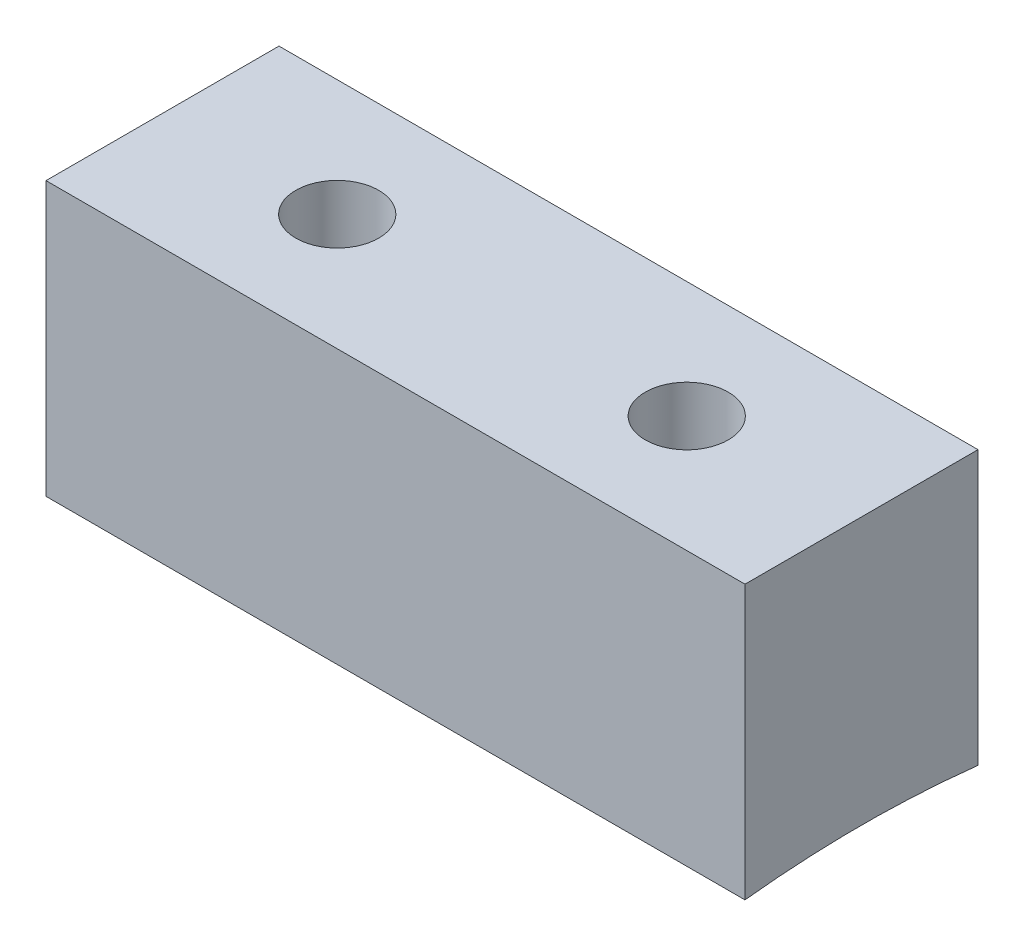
ISO-10303-21;
HEADER;
FILE_DESCRIPTION(('STEP AP214'),'2;1');
FILE_NAME('part.step','',(''),(''),'','','');
FILE_SCHEMA(('AUTOMOTIVE_DESIGN { 1 0 10303 214 1 1 1 1 }'));
ENDSEC;
DATA;
#1=APPLICATION_CONTEXT('core data for automotive mechanical design processes');
#2=APPLICATION_PROTOCOL_DEFINITION('international standard','automotive_design',2000,#1);
#3=PRODUCT_CONTEXT('',#1,'mechanical');
#4=PRODUCT('Part','Part','',(#3));
#5=PRODUCT_RELATED_PRODUCT_CATEGORY('part','',(#4));
#6=PRODUCT_DEFINITION_FORMATION('','',#4);
#7=PRODUCT_DEFINITION_CONTEXT('part definition',#1,'design');
#8=PRODUCT_DEFINITION('design','',#6,#7);
#9=PRODUCT_DEFINITION_SHAPE('','',#8);
#10=(LENGTH_UNIT() NAMED_UNIT(*) SI_UNIT(.MILLI.,.METRE.));
#11=(NAMED_UNIT(*) PLANE_ANGLE_UNIT() SI_UNIT($,.RADIAN.));
#12=(NAMED_UNIT(*) SI_UNIT($,.STERADIAN.) SOLID_ANGLE_UNIT());
#13=UNCERTAINTY_MEASURE_WITH_UNIT(LENGTH_MEASURE(1.E-05),#10,'distance_accuracy_value','');
#14=(GEOMETRIC_REPRESENTATION_CONTEXT(3) GLOBAL_UNCERTAINTY_ASSIGNED_CONTEXT((#13)) GLOBAL_UNIT_ASSIGNED_CONTEXT((#10,
#11,#12)) REPRESENTATION_CONTEXT('',''));
#15=CARTESIAN_POINT('',(0.,0.,0.));
#16=DIRECTION('',(0.,0.,1.));
#17=DIRECTION('',(1.,0.,0.));
#18=AXIS2_PLACEMENT_3D('',#15,#16,#17);
#19=CARTESIAN_POINT('',(0.,7.45236,6.35));
#20=DIRECTION('',(0.,-1.,0.));
#21=DIRECTION('',(0.,0.,-1.));
#22=AXIS2_PLACEMENT_3D('',#19,#20,#21);
#23=PLANE('',#22);
#24=DIRECTION('',(-1.,0.,0.));
#25=VECTOR('',#24,1.);
#26=CARTESIAN_POINT('',(0.,7.45236,0.));
#27=LINE('',#26,#25);
#28=CARTESIAN_POINT('',(0.,7.45236,0.));
#29=VERTEX_POINT('',#28);
#30=CARTESIAN_POINT('',(-19.05,7.45236,0.));
#31=VERTEX_POINT('',#30);
#32=EDGE_CURVE('E102',#29,#31,#27,.T.);
#33=ORIENTED_EDGE('',*,*,#32,.T.);
#34=DIRECTION('',(0.,0.,-1.));
#35=VECTOR('',#34,1.);
#36=CARTESIAN_POINT('',(-19.05,7.45236,6.35));
#37=LINE('',#36,#35);
#38=CARTESIAN_POINT('',(-19.05,7.45236,6.35));
#39=VERTEX_POINT('',#38);
#40=EDGE_CURVE('E44',#39,#31,#37,.T.);
#41=ORIENTED_EDGE('',*,*,#40,.F.);
#42=DIRECTION('',(-1.,0.,0.));
#43=VECTOR('',#42,1.);
#44=CARTESIAN_POINT('',(0.,7.45236,6.35));
#45=LINE('',#44,#43);
#46=CARTESIAN_POINT('',(0.,7.45236,6.35));
#47=VERTEX_POINT('',#46);
#48=EDGE_CURVE('E51',#47,#39,#45,.T.);
#49=ORIENTED_EDGE('',*,*,#48,.F.);
#50=DIRECTION('',(0.,0.,-1.));
#51=VECTOR('',#50,1.);
#52=CARTESIAN_POINT('',(0.,7.45236,6.35));
#53=LINE('',#52,#51);
#54=EDGE_CURVE('E11',#47,#29,#53,.T.);
#55=ORIENTED_EDGE('',*,*,#54,.T.);
#56=EDGE_LOOP('',(#33,#41,#49,#55));
#57=FACE_BOUND('',#56,.T.);
#58=CARTESIAN_POINT('',(-4.7625,7.45236,3.175));
#59=DIRECTION('',(0.,1.,0.));
#60=DIRECTION('',(0.,0.,1.));
#61=AXIS2_PLACEMENT_3D('',#58,#59,#60);
#62=CIRCLE('',#61,1.13029999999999);
#63=CARTESIAN_POINT('',(-4.7625,7.45236,4.30529999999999));
#64=VERTEX_POINT('',#63);
#65=EDGE_CURVE('E117',#64,#64,#62,.T.);
#66=ORIENTED_EDGE('',*,*,#65,.F.);
#67=EDGE_LOOP('',(#66));
#68=FACE_BOUND('',#67,.T.);
#69=CARTESIAN_POINT('',(-14.2875,7.45236,3.175));
#70=DIRECTION('',(0.,1.,0.));
#71=DIRECTION('',(0.,0.,1.));
#72=AXIS2_PLACEMENT_3D('',#69,#70,#71);
#73=CIRCLE('',#72,1.13029999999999);
#74=CARTESIAN_POINT('',(-14.2875,7.45236,4.30529999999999));
#75=VERTEX_POINT('',#74);
#76=EDGE_CURVE('E120',#75,#75,#73,.T.);
#77=ORIENTED_EDGE('',*,*,#76,.F.);
#78=EDGE_LOOP('',(#77));
#79=FACE_BOUND('',#78,.T.);
#80=ADVANCED_FACE('F31',(#57,#68,#79),#23,.F.);
#81=CARTESIAN_POINT('',(0.,0.,6.35));
#82=DIRECTION('',(-1.,0.,0.));
#83=DIRECTION('',(0.,0.,1.));
#84=AXIS2_PLACEMENT_3D('',#81,#82,#83);
#85=PLANE('',#84);
#86=DIRECTION('',(0.,1.,0.));
#87=VECTOR('',#86,1.);
#88=CARTESIAN_POINT('',(0.,0.,6.35));
#89=LINE('',#88,#87);
#90=CARTESIAN_POINT('',(0.,0.,6.35));
#91=VERTEX_POINT('',#90);
#92=EDGE_CURVE('E95',#91,#47,#89,.T.);
#93=ORIENTED_EDGE('',*,*,#92,.F.);
#94=CARTESIAN_POINT('',(0.,-28.3980633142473,3.175));
#95=DIRECTION('',(1.,0.,0.));
#96=DIRECTION('',(0.,0.,-1.));
#97=AXIS2_PLACEMENT_3D('',#94,#95,#96);
#98=CIRCLE('',#97,28.575);
#99=CARTESIAN_POINT('',(0.,0.,0.));
#100=VERTEX_POINT('',#99);
#101=EDGE_CURVE('E81',#100,#91,#98,.T.);
#102=ORIENTED_EDGE('',*,*,#101,.F.);
#103=DIRECTION('',(0.,1.,0.));
#104=VECTOR('',#103,1.);
#105=CARTESIAN_POINT('',(0.,0.,0.));
#106=LINE('',#105,#104);
#107=EDGE_CURVE('E106',#100,#29,#106,.T.);
#108=ORIENTED_EDGE('',*,*,#107,.T.);
#109=ORIENTED_EDGE('',*,*,#54,.F.);
#110=EDGE_LOOP('',(#93,#102,#108,#109));
#111=FACE_BOUND('',#110,.T.);
#112=ADVANCED_FACE('F33',(#111),#85,.F.);
#113=CARTESIAN_POINT('',(-19.05,0.,6.35));
#114=DIRECTION('',(1.,0.,0.));
#115=DIRECTION('',(0.,1.,0.));
#116=AXIS2_PLACEMENT_3D('',#113,#114,#115);
#117=PLANE('',#116);
#118=DIRECTION('',(0.,-1.,0.));
#119=VECTOR('',#118,1.);
#120=CARTESIAN_POINT('',(-19.05,0.,0.));
#121=LINE('',#120,#119);
#122=CARTESIAN_POINT('',(-19.05,0.,0.));
#123=VERTEX_POINT('',#122);
#124=EDGE_CURVE('E90',#31,#123,#121,.T.);
#125=ORIENTED_EDGE('',*,*,#124,.T.);
#126=CARTESIAN_POINT('',(-19.05,-28.3980633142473,3.175));
#127=DIRECTION('',(1.,0.,0.));
#128=DIRECTION('',(0.,0.,-1.));
#129=AXIS2_PLACEMENT_3D('',#126,#127,#128);
#130=CIRCLE('',#129,28.575);
#131=CARTESIAN_POINT('',(-19.05,0.,6.35));
#132=VERTEX_POINT('',#131);
#133=EDGE_CURVE('E78',#123,#132,#130,.T.);
#134=ORIENTED_EDGE('',*,*,#133,.T.);
#135=DIRECTION('',(0.,-1.,0.));
#136=VECTOR('',#135,1.);
#137=CARTESIAN_POINT('',(-19.05,0.,6.35));
#138=LINE('',#137,#136);
#139=EDGE_CURVE('E83',#39,#132,#138,.T.);
#140=ORIENTED_EDGE('',*,*,#139,.F.);
#141=ORIENTED_EDGE('',*,*,#40,.T.);
#142=EDGE_LOOP('',(#125,#134,#140,#141));
#143=FACE_BOUND('',#142,.T.);
#144=ADVANCED_FACE('F87',(#143),#117,.F.);
#145=CARTESIAN_POINT('',(0.,7.45236,6.35));
#146=DIRECTION('',(0.,0.,1.));
#147=DIRECTION('',(1.,0.,0.));
#148=AXIS2_PLACEMENT_3D('',#145,#146,#147);
#149=PLANE('',#148);
#150=ORIENTED_EDGE('',*,*,#92,.T.);
#151=ORIENTED_EDGE('',*,*,#48,.T.);
#152=ORIENTED_EDGE('',*,*,#139,.T.);
#153=DIRECTION('',(1.,0.,0.));
#154=VECTOR('',#153,1.);
#155=CARTESIAN_POINT('',(0.,0.,6.35));
#156=LINE('',#155,#154);
#157=EDGE_CURVE('E74',#132,#91,#156,.T.);
#158=ORIENTED_EDGE('',*,*,#157,.T.);
#159=EDGE_LOOP('',(#150,#151,#152,#158));
#160=FACE_BOUND('',#159,.T.);
#161=ADVANCED_FACE('F93',(#160),#149,.T.);
#162=CARTESIAN_POINT('',(0.,7.45236,0.));
#163=DIRECTION('',(0.,0.,1.));
#164=DIRECTION('',(1.,0.,0.));
#165=AXIS2_PLACEMENT_3D('',#162,#163,#164);
#166=PLANE('',#165);
#167=ORIENTED_EDGE('',*,*,#107,.F.);
#168=DIRECTION('',(1.,0.,0.));
#169=VECTOR('',#168,1.);
#170=CARTESIAN_POINT('',(0.,0.,0.));
#171=LINE('',#170,#169);
#172=EDGE_CURVE('E103',#123,#100,#171,.T.);
#173=ORIENTED_EDGE('',*,*,#172,.F.);
#174=ORIENTED_EDGE('',*,*,#124,.F.);
#175=ORIENTED_EDGE('',*,*,#32,.F.);
#176=EDGE_LOOP('',(#167,#173,#174,#175));
#177=FACE_BOUND('',#176,.T.);
#178=ADVANCED_FACE('F101',(#177),#166,.F.);
#179=CARTESIAN_POINT('',(-4.7625,7.45236,3.175));
#180=DIRECTION('',(0.,1.,0.));
#181=DIRECTION('',(0.,0.,1.));
#182=AXIS2_PLACEMENT_3D('',#179,#180,#181);
#183=CYLINDRICAL_SURFACE('',#182,1.13029999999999);
#184=CARTESIAN_POINT('',(-4.7625,0.154573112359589,4.30529999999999));
#185=CARTESIAN_POINT('',(-4.82596279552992,0.154573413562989,4.3052971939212));
#186=CARTESIAN_POINT('',(-4.88947097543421,0.154786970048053,4.29993719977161));
#187=CARTESIAN_POINT('',(-5.01473645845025,0.155618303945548,4.2786305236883));
#188=CARTESIAN_POINT('',(-5.07649159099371,0.15623656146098,4.26267126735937));
#189=CARTESIAN_POINT('',(-5.19641818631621,0.157807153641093,4.2206227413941));
#190=CARTESIAN_POINT('',(-5.25459141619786,0.158759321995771,4.19453851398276));
#191=CARTESIAN_POINT('',(-5.36571745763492,0.160890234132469,4.13298792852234));
#192=CARTESIAN_POINT('',(-5.41867152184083,0.162068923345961,4.09752382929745));
#193=CARTESIAN_POINT('',(-5.51790852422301,0.164520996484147,4.01819249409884));
#194=CARTESIAN_POINT('',(-5.56418748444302,0.165794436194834,3.97432028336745));
#195=CARTESIAN_POINT('',(-5.64872685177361,0.168291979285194,3.87942755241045));
#196=CARTESIAN_POINT('',(-5.68698693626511,0.169516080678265,3.82840674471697));
#197=CARTESIAN_POINT('',(-5.75441158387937,0.171777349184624,3.72064666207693));
#198=CARTESIAN_POINT('',(-5.78357332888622,0.172814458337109,3.66390562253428));
#199=CARTESIAN_POINT('',(-5.83195533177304,0.174584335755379,3.54632822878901));
#200=CARTESIAN_POINT('',(-5.85117564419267,0.175317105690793,3.48549189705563));
#201=CARTESIAN_POINT('',(-5.87911944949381,0.17639536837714,3.36148487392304));
#202=CARTESIAN_POINT('',(-5.88784848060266,0.176741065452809,3.29831543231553));
#203=CARTESIAN_POINT('',(-5.89457901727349,0.177006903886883,3.17140696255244));
#204=CARTESIAN_POINT('',(-5.89258058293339,0.176927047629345,3.10766793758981));
#205=CARTESIAN_POINT('',(-5.87791754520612,0.17635095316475,2.9814671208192));
#206=CARTESIAN_POINT('',(-5.86525890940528,0.175854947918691,2.91900463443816));
#207=CARTESIAN_POINT('',(-5.82964404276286,0.17450271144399,2.79709195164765));
#208=CARTESIAN_POINT('',(-5.80668778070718,0.173646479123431,2.73764176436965));
#209=CARTESIAN_POINT('',(-5.75112247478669,0.171669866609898,2.62342202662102));
#210=CARTESIAN_POINT('',(-5.71851070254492,0.170549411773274,2.56865380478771));
#211=CARTESIAN_POINT('',(-5.64456211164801,0.168170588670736,2.4653672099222));
#212=CARTESIAN_POINT('',(-5.60322525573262,0.166912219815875,2.41684886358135));
#213=CARTESIAN_POINT('',(-5.51296613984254,0.164398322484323,2.32740448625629));
#214=CARTESIAN_POINT('',(-5.46403870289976,0.16314279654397,2.28648367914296));
#215=CARTESIAN_POINT('',(-5.36000552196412,0.160776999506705,2.21343619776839));
#216=CARTESIAN_POINT('',(-5.30489977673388,0.159666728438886,2.18130952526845));
#217=CARTESIAN_POINT('',(-5.19007119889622,0.157716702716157,2.12676279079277));
#218=CARTESIAN_POINT('',(-5.13034828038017,0.156876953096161,2.10434290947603));
#219=CARTESIAN_POINT('',(-5.00798203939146,0.155562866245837,2.06984959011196));
#220=CARTESIAN_POINT('',(-4.94533873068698,0.155088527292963,2.05777610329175));
#221=CARTESIAN_POINT('',(-4.81895539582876,0.154559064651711,2.04432472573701));
#222=CARTESIAN_POINT('',(-4.75521614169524,0.154503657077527,2.04293959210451));
#223=CARTESIAN_POINT('',(-4.62841028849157,0.154817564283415,2.05088535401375));
#224=CARTESIAN_POINT('',(-4.56534368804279,0.155186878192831,2.06021622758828));
#225=CARTESIAN_POINT('',(-4.4416936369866,0.15630833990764,2.08932313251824));
#226=CARTESIAN_POINT('',(-4.38110940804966,0.157060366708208,2.10909586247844));
#227=CARTESIAN_POINT('',(-4.26411993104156,0.158862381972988,2.15852186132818));
#228=CARTESIAN_POINT('',(-4.20771469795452,0.159912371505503,2.18817516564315));
#229=CARTESIAN_POINT('',(-4.10065100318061,0.162192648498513,2.25653920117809));
#230=CARTESIAN_POINT('',(-4.04999565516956,0.163423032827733,2.29525480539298));
#231=CARTESIAN_POINT('',(-3.95590094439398,0.165925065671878,2.38063730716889));
#232=CARTESIAN_POINT('',(-3.91246161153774,0.167196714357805,2.4273042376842));
#233=CARTESIAN_POINT('',(-3.83400776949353,0.169638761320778,2.52729574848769));
#234=CARTESIAN_POINT('',(-3.79899793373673,0.17080910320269,2.58062399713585));
#235=CARTESIAN_POINT('',(-3.73842882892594,0.172915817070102,2.69240572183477));
#236=CARTESIAN_POINT('',(-3.71286953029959,0.173852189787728,2.75085918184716));
#237=CARTESIAN_POINT('',(-3.67193522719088,0.175385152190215,2.87121452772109));
#238=CARTESIAN_POINT('',(-3.65655721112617,0.175981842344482,2.93311538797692));
#239=CARTESIAN_POINT('',(-3.63641212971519,0.1767685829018,3.05862284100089));
#240=CARTESIAN_POINT('',(-3.63164503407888,0.176958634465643,3.1222294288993));
#241=CARTESIAN_POINT('',(-3.63285745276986,0.176910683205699,3.24929625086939));
#242=CARTESIAN_POINT('',(-3.63882962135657,0.176672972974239,3.31275655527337));
#243=CARTESIAN_POINT('',(-3.66133589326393,0.17579684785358,3.43777293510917));
#244=CARTESIAN_POINT('',(-3.67787001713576,0.175158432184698,3.49932900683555));
#245=CARTESIAN_POINT('',(-3.72102954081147,0.173552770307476,3.61879160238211));
#246=CARTESIAN_POINT('',(-3.74765507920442,0.172585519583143,3.6766980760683));
#247=CARTESIAN_POINT('',(-3.81023992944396,0.170431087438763,3.78721857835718));
#248=CARTESIAN_POINT('',(-3.84619892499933,0.169243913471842,3.8398327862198));
#249=CARTESIAN_POINT('',(-3.92645468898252,0.166782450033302,3.93831094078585));
#250=CARTESIAN_POINT('',(-3.97075625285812,0.165508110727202,3.98417097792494));
#251=CARTESIAN_POINT('',(-4.06644253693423,0.16301615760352,4.06781607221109));
#252=CARTESIAN_POINT('',(-4.11782900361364,0.161798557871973,4.10559913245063));
#253=CARTESIAN_POINT('',(-4.2262549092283,0.159556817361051,4.17202882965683));
#254=CARTESIAN_POINT('',(-4.28329870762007,0.158532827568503,4.20066834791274));
#255=CARTESIAN_POINT('',(-4.40134558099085,0.156796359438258,4.24792991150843));
#256=CARTESIAN_POINT('',(-4.46234385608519,0.156083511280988,4.26656385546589));
#257=CARTESIAN_POINT('',(-4.56352070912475,0.155239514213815,4.28836806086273));
#258=CARTESIAN_POINT('',(-4.6030431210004,0.154990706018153,4.29470950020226));
#259=CARTESIAN_POINT('',(-4.68253768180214,0.154657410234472,4.30317635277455));
#260=CARTESIAN_POINT('',(-4.72250983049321,0.15457292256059,4.30530176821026));
#261=CARTESIAN_POINT('',(-4.7625,0.154573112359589,4.30529999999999));
#262=B_SPLINE_CURVE_WITH_KNOTS('',3,(#184,#185,#186,#187,#188,#189,#190,#191,#192,#193,#194,
#195,#196,#197,#198,#199,#200,#201,#202,#203,#204,#205,#206,#207,#208,#209,#210,#211,#212,#213,
#214,#215,#216,#217,#218,#219,#220,#221,#222,#223,#224,#225,#226,#227,#228,#229,#230,#231,#232,
#233,#234,#235,#236,#237,#238,#239,#240,#241,#242,#243,#244,#245,#246,#247,#248,#249,#250,#251,
#252,#253,#254,#255,#256,#257,#258,#259,#260,#261),.UNSPECIFIED.,.T.,.F.,(4,2,2,2,2,2,2,2,2,2,2,
2,2,2,2,2,2,2,2,2,2,2,2,2,2,2,2,2,2,2,2,2,2,2,2,2,2,2,4),(0.,0.190242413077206,
0.380710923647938,0.57108470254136,0.761412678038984,0.951853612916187,1.14230220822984,
1.33280973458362,1.5233162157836,1.71372208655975,1.90412689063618,2.09442517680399,
2.28472403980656,2.47507672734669,2.66543022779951,2.85591412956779,3.04639806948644,
3.23688555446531,3.42737214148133,3.61772963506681,3.80808673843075,3.99838369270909,
4.18868132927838,4.37908152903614,4.56948251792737,4.75998882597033,4.95049453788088,
5.1409438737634,5.33139266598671,5.52171123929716,5.7120301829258,5.90235174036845,
6.09266684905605,6.28309168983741,6.47356355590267,6.66418335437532,6.85457596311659,
6.97445455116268,7.09433307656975),.UNSPECIFIED.);
#263=CARTESIAN_POINT('',(-4.7625,0.154573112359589,4.30529999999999));
#264=VERTEX_POINT('',#263);
#265=EDGE_CURVE('E122',#264,#264,#262,.T.);
#266=ORIENTED_EDGE('',*,*,#265,.T.);
#267=EDGE_LOOP('',(#266));
#268=FACE_BOUND('',#267,.T.);
#269=ORIENTED_EDGE('',*,*,#65,.T.);
#270=EDGE_LOOP('',(#269));
#271=FACE_BOUND('',#270,.T.);
#272=ADVANCED_FACE('F131',(#268,#271),#183,.F.);
#273=CARTESIAN_POINT('',(-14.2875,7.45236,3.175));
#274=DIRECTION('',(0.,1.,0.));
#275=DIRECTION('',(0.,0.,1.));
#276=AXIS2_PLACEMENT_3D('',#273,#274,#275);
#277=CYLINDRICAL_SURFACE('',#276,1.13029999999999);
#278=CARTESIAN_POINT('',(-14.2875,0.154573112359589,4.30529999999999));
#279=CARTESIAN_POINT('',(-14.3509627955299,0.154573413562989,4.3052971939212));
#280=CARTESIAN_POINT('',(-14.4144709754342,0.154786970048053,4.29993719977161));
#281=CARTESIAN_POINT('',(-14.5397364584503,0.155618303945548,4.2786305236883));
#282=CARTESIAN_POINT('',(-14.6014915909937,0.15623656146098,4.26267126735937));
#283=CARTESIAN_POINT('',(-14.7214181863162,0.157807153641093,4.2206227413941));
#284=CARTESIAN_POINT('',(-14.7795914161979,0.158759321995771,4.19453851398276));
#285=CARTESIAN_POINT('',(-14.8907174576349,0.160890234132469,4.13298792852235));
#286=CARTESIAN_POINT('',(-14.9436715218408,0.16206892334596,4.09752382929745));
#287=CARTESIAN_POINT('',(-15.042908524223,0.164520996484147,4.01819249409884));
#288=CARTESIAN_POINT('',(-15.089187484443,0.165794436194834,3.97432028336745));
#289=CARTESIAN_POINT('',(-15.1737268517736,0.168291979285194,3.87942755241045));
#290=CARTESIAN_POINT('',(-15.2119869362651,0.169516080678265,3.82840674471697));
#291=CARTESIAN_POINT('',(-15.2794115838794,0.171777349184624,3.72064666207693));
#292=CARTESIAN_POINT('',(-15.3085733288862,0.172814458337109,3.66390562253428));
#293=CARTESIAN_POINT('',(-15.356955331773,0.174584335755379,3.54632822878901));
#294=CARTESIAN_POINT('',(-15.3761756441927,0.175317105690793,3.48549189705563));
#295=CARTESIAN_POINT('',(-15.4041194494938,0.17639536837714,3.36148487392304));
#296=CARTESIAN_POINT('',(-15.4128484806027,0.176741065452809,3.29831543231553));
#297=CARTESIAN_POINT('',(-15.4195790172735,0.177006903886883,3.17140696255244));
#298=CARTESIAN_POINT('',(-15.4175805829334,0.176927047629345,3.10766793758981));
#299=CARTESIAN_POINT('',(-15.4029175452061,0.17635095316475,2.9814671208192));
#300=CARTESIAN_POINT('',(-15.3902589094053,0.175854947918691,2.91900463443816));
#301=CARTESIAN_POINT('',(-15.3546440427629,0.17450271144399,2.79709195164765));
#302=CARTESIAN_POINT('',(-15.3316877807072,0.173646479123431,2.73764176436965));
#303=CARTESIAN_POINT('',(-15.2761224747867,0.171669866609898,2.62342202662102));
#304=CARTESIAN_POINT('',(-15.2435107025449,0.170549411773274,2.56865380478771));
#305=CARTESIAN_POINT('',(-15.169562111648,0.168170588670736,2.4653672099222));
#306=CARTESIAN_POINT('',(-15.1282252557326,0.166912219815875,2.41684886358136));
#307=CARTESIAN_POINT('',(-15.0379661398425,0.164398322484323,2.32740448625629));
#308=CARTESIAN_POINT('',(-14.9890387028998,0.16314279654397,2.28648367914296));
#309=CARTESIAN_POINT('',(-14.8850055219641,0.160776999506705,2.21343619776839));
#310=CARTESIAN_POINT('',(-14.8298997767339,0.159666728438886,2.18130952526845));
#311=CARTESIAN_POINT('',(-14.7150711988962,0.157716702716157,2.12676279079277));
#312=CARTESIAN_POINT('',(-14.6553482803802,0.156876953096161,2.10434290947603));
#313=CARTESIAN_POINT('',(-14.5329820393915,0.155562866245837,2.06984959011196));
#314=CARTESIAN_POINT('',(-14.470338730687,0.155088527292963,2.05777610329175));
#315=CARTESIAN_POINT('',(-14.3439553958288,0.154559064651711,2.04432472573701));
#316=CARTESIAN_POINT('',(-14.2802161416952,0.154503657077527,2.04293959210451));
#317=CARTESIAN_POINT('',(-14.1534102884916,0.154817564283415,2.05088535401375));
#318=CARTESIAN_POINT('',(-14.0903436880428,0.155186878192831,2.06021622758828));
#319=CARTESIAN_POINT('',(-13.9666936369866,0.15630833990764,2.08932313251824));
#320=CARTESIAN_POINT('',(-13.9061094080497,0.157060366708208,2.10909586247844));
#321=CARTESIAN_POINT('',(-13.7891199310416,0.158862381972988,2.15852186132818));
#322=CARTESIAN_POINT('',(-13.7327146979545,0.159912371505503,2.18817516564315));
#323=CARTESIAN_POINT('',(-13.6256510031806,0.162192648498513,2.25653920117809));
#324=CARTESIAN_POINT('',(-13.5749956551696,0.163423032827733,2.29525480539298));
#325=CARTESIAN_POINT('',(-13.480900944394,0.165925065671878,2.38063730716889));
#326=CARTESIAN_POINT('',(-13.4374616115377,0.167196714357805,2.4273042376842));
#327=CARTESIAN_POINT('',(-13.3590077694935,0.169638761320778,2.52729574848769));
#328=CARTESIAN_POINT('',(-13.3239979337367,0.17080910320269,2.58062399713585));
#329=CARTESIAN_POINT('',(-13.2634288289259,0.172915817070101,2.69240572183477));
#330=CARTESIAN_POINT('',(-13.2378695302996,0.173852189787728,2.75085918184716));
#331=CARTESIAN_POINT('',(-13.1969352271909,0.175385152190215,2.87121452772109));
#332=CARTESIAN_POINT('',(-13.1815572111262,0.175981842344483,2.93311538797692));
#333=CARTESIAN_POINT('',(-13.1614121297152,0.1767685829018,3.05862284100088));
#334=CARTESIAN_POINT('',(-13.1566450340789,0.176958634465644,3.1222294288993));
#335=CARTESIAN_POINT('',(-13.1578574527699,0.176910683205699,3.24929625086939));
#336=CARTESIAN_POINT('',(-13.1638296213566,0.176672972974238,3.31275655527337));
#337=CARTESIAN_POINT('',(-13.1863358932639,0.175796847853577,3.43777293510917));
#338=CARTESIAN_POINT('',(-13.2028700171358,0.175158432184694,3.49932900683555));
#339=CARTESIAN_POINT('',(-13.2460295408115,0.173552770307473,3.61879160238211));
#340=CARTESIAN_POINT('',(-13.2726550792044,0.172585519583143,3.6766980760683));
#341=CARTESIAN_POINT('',(-13.335239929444,0.170431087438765,3.78721857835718));
#342=CARTESIAN_POINT('',(-13.3711989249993,0.169243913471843,3.8398327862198));
#343=CARTESIAN_POINT('',(-13.4514546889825,0.166782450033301,3.93831094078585));
#344=CARTESIAN_POINT('',(-13.4957562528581,0.165508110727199,3.98417097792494));
#345=CARTESIAN_POINT('',(-13.5914425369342,0.163016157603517,4.06781607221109));
#346=CARTESIAN_POINT('',(-13.6428290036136,0.161798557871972,4.10559913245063));
#347=CARTESIAN_POINT('',(-13.7512549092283,0.159556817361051,4.17202882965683));
#348=CARTESIAN_POINT('',(-13.8082987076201,0.158532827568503,4.20066834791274));
#349=CARTESIAN_POINT('',(-13.9263455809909,0.156796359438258,4.24792991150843));
#350=CARTESIAN_POINT('',(-13.9873438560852,0.156083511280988,4.26656385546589));
#351=CARTESIAN_POINT('',(-14.0885207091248,0.155239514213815,4.28836806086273));
#352=CARTESIAN_POINT('',(-14.1280431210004,0.154990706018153,4.29470950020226));
#353=CARTESIAN_POINT('',(-14.2075376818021,0.154657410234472,4.30317635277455));
#354=CARTESIAN_POINT('',(-14.2475098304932,0.15457292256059,4.30530176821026));
#355=CARTESIAN_POINT('',(-14.2875,0.154573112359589,4.30529999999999));
#356=B_SPLINE_CURVE_WITH_KNOTS('',3,(#278,#279,#280,#281,#282,#283,#284,#285,#286,#287,#288,
#289,#290,#291,#292,#293,#294,#295,#296,#297,#298,#299,#300,#301,#302,#303,#304,#305,#306,#307,
#308,#309,#310,#311,#312,#313,#314,#315,#316,#317,#318,#319,#320,#321,#322,#323,#324,#325,#326,
#327,#328,#329,#330,#331,#332,#333,#334,#335,#336,#337,#338,#339,#340,#341,#342,#343,#344,#345,
#346,#347,#348,#349,#350,#351,#352,#353,#354,#355),.UNSPECIFIED.,.T.,.F.,(4,2,2,2,2,2,2,2,2,2,2,
2,2,2,2,2,2,2,2,2,2,2,2,2,2,2,2,2,2,2,2,2,2,2,2,2,2,2,4),(0.,0.190242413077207,
0.380710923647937,0.571084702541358,0.76141267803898,0.951853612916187,1.14230220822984,
1.33280973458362,1.5233162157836,1.71372208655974,1.90412689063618,2.09442517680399,
2.28472403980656,2.47507672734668,2.6654302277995,2.85591412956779,3.04639806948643,
3.2368855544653,3.42737214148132,3.61772963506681,3.80808673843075,3.99838369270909,
4.18868132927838,4.37908152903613,4.56948251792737,4.75998882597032,4.95049453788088,
5.1409438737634,5.33139266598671,5.52171123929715,5.71203018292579,5.90235174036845,
6.09266684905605,6.28309168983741,6.47356355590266,6.66418335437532,6.85457596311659,
6.97445455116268,7.09433307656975),.UNSPECIFIED.);
#357=CARTESIAN_POINT('',(-14.2875,0.154573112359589,4.30529999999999));
#358=VERTEX_POINT('',#357);
#359=EDGE_CURVE('E35',#358,#358,#356,.T.);
#360=ORIENTED_EDGE('',*,*,#359,.T.);
#361=EDGE_LOOP('',(#360));
#362=FACE_BOUND('',#361,.T.);
#363=ORIENTED_EDGE('',*,*,#76,.T.);
#364=EDGE_LOOP('',(#363));
#365=FACE_BOUND('',#364,.T.);
#366=ADVANCED_FACE('F136',(#362,#365),#277,.F.);
#367=CARTESIAN_POINT('',(-19.05,-28.3980633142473,3.175));
#368=DIRECTION('',(1.,0.,0.));
#369=DIRECTION('',(0.,0.,-1.));
#370=AXIS2_PLACEMENT_3D('',#367,#368,#369);
#371=CYLINDRICAL_SURFACE('',#370,28.575);
#372=ORIENTED_EDGE('',*,*,#157,.F.);
#373=ORIENTED_EDGE('',*,*,#133,.F.);
#374=ORIENTED_EDGE('',*,*,#172,.T.);
#375=ORIENTED_EDGE('',*,*,#101,.T.);
#376=EDGE_LOOP('',(#372,#373,#374,#375));
#377=FACE_BOUND('',#376,.T.);
#378=ORIENTED_EDGE('',*,*,#359,.F.);
#379=EDGE_LOOP('',(#378));
#380=FACE_BOUND('',#379,.T.);
#381=ORIENTED_EDGE('',*,*,#265,.F.);
#382=EDGE_LOOP('',(#381));
#383=FACE_BOUND('',#382,.T.);
#384=ADVANCED_FACE('F76',(#377,#380,#383),#371,.F.);
#385=CLOSED_SHELL('',(#80,#112,#144,#161,#178,#272,#366,#384));
#386=MANIFOLD_SOLID_BREP('B2',#385);
#387=ADVANCED_BREP_SHAPE_REPRESENTATION('',(#18,#386),#14);
#388=SHAPE_DEFINITION_REPRESENTATION(#9,#387);
ENDSEC;
END-ISO-10303-21;
